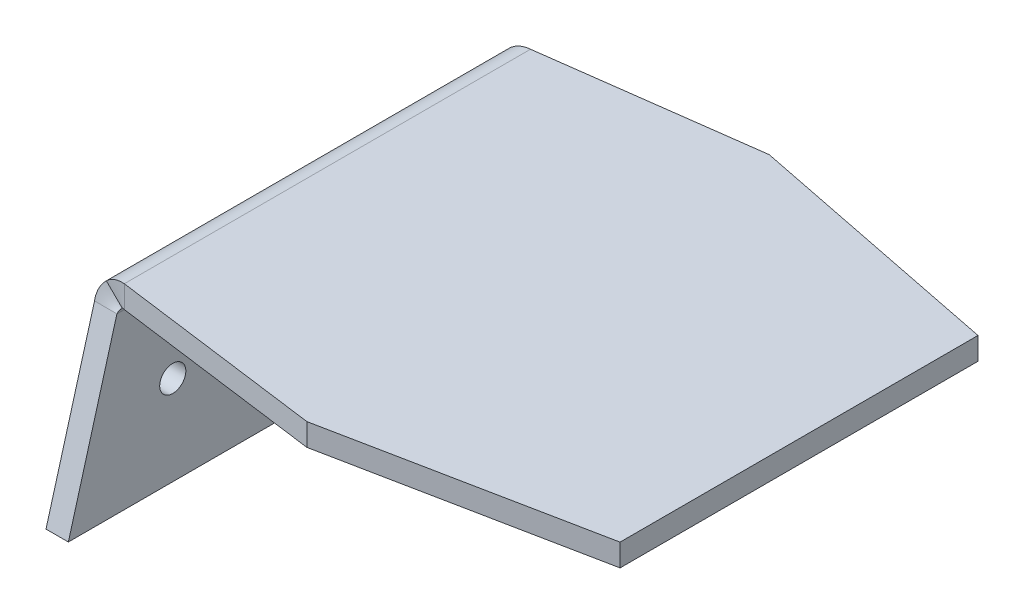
ISO-10303-21;
HEADER;
FILE_DESCRIPTION(('STEP AP214'),'2;1');
FILE_NAME('part.step','',(''),(''),'','','');
FILE_SCHEMA(('AUTOMOTIVE_DESIGN { 1 0 10303 214 1 1 1 1 }'));
ENDSEC;
DATA;
#1=APPLICATION_CONTEXT('core data for automotive mechanical design processes');
#2=APPLICATION_PROTOCOL_DEFINITION('international standard','automotive_design',2000,#1);
#3=PRODUCT_CONTEXT('',#1,'mechanical');
#4=PRODUCT('Part','Part','',(#3));
#5=PRODUCT_RELATED_PRODUCT_CATEGORY('part','',(#4));
#6=PRODUCT_DEFINITION_FORMATION('','',#4);
#7=PRODUCT_DEFINITION_CONTEXT('part definition',#1,'design');
#8=PRODUCT_DEFINITION('design','',#6,#7);
#9=PRODUCT_DEFINITION_SHAPE('','',#8);
#10=(LENGTH_UNIT() NAMED_UNIT(*) SI_UNIT(.MILLI.,.METRE.));
#11=(NAMED_UNIT(*) PLANE_ANGLE_UNIT() SI_UNIT($,.RADIAN.));
#12=(NAMED_UNIT(*) SI_UNIT($,.STERADIAN.) SOLID_ANGLE_UNIT());
#13=UNCERTAINTY_MEASURE_WITH_UNIT(LENGTH_MEASURE(1.E-05),#10,'distance_accuracy_value','');
#14=(GEOMETRIC_REPRESENTATION_CONTEXT(3) GLOBAL_UNCERTAINTY_ASSIGNED_CONTEXT((#13)) GLOBAL_UNIT_ASSIGNED_CONTEXT((#10,
#11,#12)) REPRESENTATION_CONTEXT('',''));
#15=CARTESIAN_POINT('',(0.,0.,0.));
#16=DIRECTION('',(0.,0.,1.));
#17=DIRECTION('',(1.,0.,0.));
#18=AXIS2_PLACEMENT_3D('',#15,#16,#17);
#19=CARTESIAN_POINT('',(26.0200215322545,66.0200215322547,-8.80000000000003));
#20=DIRECTION('',(1.,0.,0.));
#21=DIRECTION('',(0.,0.,-1.));
#22=AXIS2_PLACEMENT_3D('',#19,#20,#21);
#23=PLANE('',#22);
#24=CARTESIAN_POINT('',(26.0200215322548,-11.9799784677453,-20.));
#25=DIRECTION('',(-1.,0.,0.));
#26=DIRECTION('',(0.,0.,1.));
#27=AXIS2_PLACEMENT_3D('',#24,#25,#26);
#28=CIRCLE('',#27,1.75);
#29=CARTESIAN_POINT('',(26.0200215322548,-11.9799784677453,-18.25));
#30=VERTEX_POINT('',#29);
#31=EDGE_CURVE('E324',#30,#30,#28,.T.);
#32=ORIENTED_EDGE('',*,*,#31,.T.);
#33=EDGE_LOOP('',(#32));
#34=FACE_BOUND('',#33,.T.);
#35=CARTESIAN_POINT('',(26.0200215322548,-11.9799784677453,20.));
#36=DIRECTION('',(-1.,0.,0.));
#37=DIRECTION('',(0.,0.,-1.));
#38=AXIS2_PLACEMENT_3D('',#35,#36,#37);
#39=CIRCLE('',#38,1.75);
#40=CARTESIAN_POINT('',(26.0200215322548,-11.9799784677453,18.25));
#41=VERTEX_POINT('',#40);
#42=EDGE_CURVE('E327',#41,#41,#39,.T.);
#43=ORIENTED_EDGE('',*,*,#42,.T.);
#44=EDGE_LOOP('',(#43));
#45=FACE_BOUND('',#44,.T.);
#46=DIRECTION('',(0.,-0.962964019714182,-0.269629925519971));
#47=VECTOR('',#46,1.);
#48=CARTESIAN_POINT('',(26.0200215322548,-23.9799784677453,-34.));
#49=LINE('',#48,#47);
#50=CARTESIAN_POINT('',(26.0200215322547,-0.736600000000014,-27.4918540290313));
#51=VERTEX_POINT('',#50);
#52=CARTESIAN_POINT('',(26.0200215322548,-23.9799784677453,-34.));
#53=VERTEX_POINT('',#52);
#54=EDGE_CURVE('E84',#51,#53,#49,.T.);
#55=ORIENTED_EDGE('',*,*,#54,.F.);
#56=DIRECTION('',(0.,0.,1.));
#57=VECTOR('',#56,1.);
#58=CARTESIAN_POINT('',(26.0200215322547,-0.736600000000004,-8.80000000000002));
#59=LINE('',#58,#57);
#60=CARTESIAN_POINT('',(26.0200215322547,-0.736600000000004,27.4918540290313));
#61=VERTEX_POINT('',#60);
#62=EDGE_CURVE('E77',#51,#61,#59,.T.);
#63=ORIENTED_EDGE('',*,*,#62,.T.);
#64=DIRECTION('',(0.,0.962964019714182,-0.269629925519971));
#65=VECTOR('',#64,1.);
#66=CARTESIAN_POINT('',(26.0200215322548,-23.9799784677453,34.));
#67=LINE('',#66,#65);
#68=CARTESIAN_POINT('',(26.0200215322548,-23.9799784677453,34.));
#69=VERTEX_POINT('',#68);
#70=EDGE_CURVE('E92',#69,#61,#67,.T.);
#71=ORIENTED_EDGE('',*,*,#70,.F.);
#72=DIRECTION('',(0.,0.,1.));
#73=VECTOR('',#72,1.);
#74=CARTESIAN_POINT('',(26.0200215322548,-23.9799784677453,34.));
#75=LINE('',#74,#73);
#76=EDGE_CURVE('E345',#53,#69,#75,.T.);
#77=ORIENTED_EDGE('',*,*,#76,.F.);
#78=EDGE_LOOP('',(#55,#63,#71,#77));
#79=FACE_BOUND('',#78,.T.);
#80=ADVANCED_FACE('F65',(#34,#45,#79),#23,.T.);
#81=CARTESIAN_POINT('',(23.0200215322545,66.0200215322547,-8.80000000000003));
#82=DIRECTION('',(1.,0.,0.));
#83=DIRECTION('',(0.,0.,-1.));
#84=AXIS2_PLACEMENT_3D('',#81,#82,#83);
#85=PLANE('',#84);
#86=DIRECTION('',(0.,0.,1.));
#87=VECTOR('',#86,1.);
#88=CARTESIAN_POINT('',(23.0200215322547,-0.736600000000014,-8.80000000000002));
#89=LINE('',#88,#87);
#90=CARTESIAN_POINT('',(23.0200215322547,-0.736600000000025,-27.4918540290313));
#91=VERTEX_POINT('',#90);
#92=CARTESIAN_POINT('',(23.0200215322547,-0.736599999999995,27.4918540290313));
#93=VERTEX_POINT('',#92);
#94=EDGE_CURVE('E352',#91,#93,#89,.T.);
#95=ORIENTED_EDGE('',*,*,#94,.F.);
#96=DIRECTION('',(0.,-0.962964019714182,-0.269629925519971));
#97=VECTOR('',#96,1.);
#98=CARTESIAN_POINT('',(23.0200215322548,-23.9799784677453,-34.));
#99=LINE('',#98,#97);
#100=CARTESIAN_POINT('',(23.0200215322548,-23.9799784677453,-34.));
#101=VERTEX_POINT('',#100);
#102=EDGE_CURVE('E344',#91,#101,#99,.T.);
#103=ORIENTED_EDGE('',*,*,#102,.T.);
#104=DIRECTION('',(0.,0.,1.));
#105=VECTOR('',#104,1.);
#106=CARTESIAN_POINT('',(23.0200215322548,-23.9799784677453,34.));
#107=LINE('',#106,#105);
#108=CARTESIAN_POINT('',(23.0200215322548,-23.9799784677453,34.));
#109=VERTEX_POINT('',#108);
#110=EDGE_CURVE('E341',#101,#109,#107,.T.);
#111=ORIENTED_EDGE('',*,*,#110,.T.);
#112=DIRECTION('',(0.,0.962964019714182,-0.269629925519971));
#113=VECTOR('',#112,1.);
#114=CARTESIAN_POINT('',(23.0200215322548,-23.9799784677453,34.));
#115=LINE('',#114,#113);
#116=EDGE_CURVE('E343',#109,#93,#115,.T.);
#117=ORIENTED_EDGE('',*,*,#116,.T.);
#118=EDGE_LOOP('',(#95,#103,#111,#117));
#119=FACE_BOUND('',#118,.T.);
#120=CARTESIAN_POINT('',(23.0200215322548,-11.9799784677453,-20.));
#121=DIRECTION('',(-1.,0.,0.));
#122=DIRECTION('',(0.,0.,1.));
#123=AXIS2_PLACEMENT_3D('',#120,#121,#122);
#124=CIRCLE('',#123,1.75);
#125=CARTESIAN_POINT('',(23.0200215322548,-11.9799784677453,-18.25));
#126=VERTEX_POINT('',#125);
#127=EDGE_CURVE('E337',#126,#126,#124,.T.);
#128=ORIENTED_EDGE('',*,*,#127,.F.);
#129=EDGE_LOOP('',(#128));
#130=FACE_BOUND('',#129,.T.);
#131=CARTESIAN_POINT('',(23.0200215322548,-11.9799784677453,20.));
#132=DIRECTION('',(-1.,0.,0.));
#133=DIRECTION('',(0.,0.,-1.));
#134=AXIS2_PLACEMENT_3D('',#131,#132,#133);
#135=CIRCLE('',#134,1.75);
#136=CARTESIAN_POINT('',(23.0200215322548,-11.9799784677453,18.25));
#137=VERTEX_POINT('',#136);
#138=EDGE_CURVE('E329',#137,#137,#135,.T.);
#139=ORIENTED_EDGE('',*,*,#138,.F.);
#140=EDGE_LOOP('',(#139));
#141=FACE_BOUND('',#140,.T.);
#142=ADVANCED_FACE('F312',(#119,#130,#141),#85,.F.);
#143=CARTESIAN_POINT('',(23.0200215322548,-23.9799784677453,-34.));
#144=DIRECTION('',(0.,-0.269629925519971,0.962964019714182));
#145=DIRECTION('',(0.,0.962964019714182,0.269629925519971));
#146=AXIS2_PLACEMENT_3D('',#143,#144,#145);
#147=PLANE('',#146);
#148=CARTESIAN_POINT('',(26.0200215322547,-0.736600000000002,-27.4918540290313));
#149=CARTESIAN_POINT('',(23.0200215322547,-0.736600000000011,-27.4918540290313));
#150=B_SPLINE_CURVE_WITH_KNOTS('',1,(#148,#149),.UNSPECIFIED.,.F.,.F.,(2,2),(0.,1.),.UNSPECIFIED.);
#151=EDGE_CURVE('E12',#51,#91,#150,.T.);
#152=ORIENTED_EDGE('',*,*,#151,.F.);
#153=ORIENTED_EDGE('',*,*,#54,.T.);
#154=DIRECTION('',(1.,0.,0.));
#155=VECTOR('',#154,1.);
#156=CARTESIAN_POINT('',(23.0200215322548,-23.9799784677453,-34.));
#157=LINE('',#156,#155);
#158=EDGE_CURVE('E349',#101,#53,#157,.T.);
#159=ORIENTED_EDGE('',*,*,#158,.F.);
#160=ORIENTED_EDGE('',*,*,#102,.F.);
#161=EDGE_LOOP('',(#152,#153,#159,#160));
#162=FACE_BOUND('',#161,.T.);
#163=ADVANCED_FACE('F67',(#162),#147,.F.);
#164=CARTESIAN_POINT('',(23.0200215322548,-23.9799784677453,34.));
#165=DIRECTION('',(0.,1.,0.));
#166=DIRECTION('',(0.,0.,-1.));
#167=AXIS2_PLACEMENT_3D('',#164,#165,#166);
#168=PLANE('',#167);
#169=ORIENTED_EDGE('',*,*,#76,.T.);
#170=DIRECTION('',(1.,0.,0.));
#171=VECTOR('',#170,1.);
#172=CARTESIAN_POINT('',(23.0200215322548,-23.9799784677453,34.));
#173=LINE('',#172,#171);
#174=EDGE_CURVE('E347',#109,#69,#173,.T.);
#175=ORIENTED_EDGE('',*,*,#174,.F.);
#176=ORIENTED_EDGE('',*,*,#110,.F.);
#177=ORIENTED_EDGE('',*,*,#158,.T.);
#178=EDGE_LOOP('',(#169,#175,#176,#177));
#179=FACE_BOUND('',#178,.T.);
#180=ADVANCED_FACE('F308',(#179),#168,.F.);
#181=CARTESIAN_POINT('',(23.0200215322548,-23.9799784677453,34.));
#182=DIRECTION('',(0.,-0.269629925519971,-0.962964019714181));
#183=DIRECTION('',(0.,-0.962964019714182,0.269629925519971));
#184=AXIS2_PLACEMENT_3D('',#181,#182,#183);
#185=PLANE('',#184);
#186=CARTESIAN_POINT('',(23.0200215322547,-0.736599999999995,27.4918540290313));
#187=CARTESIAN_POINT('',(26.0200215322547,-0.736599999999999,27.4918540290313));
#188=B_SPLINE_CURVE_WITH_KNOTS('',1,(#186,#187),.UNSPECIFIED.,.F.,.F.,(2,2),(0.,1.),.UNSPECIFIED.);
#189=EDGE_CURVE('E358',#93,#61,#188,.T.);
#190=ORIENTED_EDGE('',*,*,#189,.F.);
#191=ORIENTED_EDGE('',*,*,#116,.F.);
#192=ORIENTED_EDGE('',*,*,#174,.T.);
#193=ORIENTED_EDGE('',*,*,#70,.T.);
#194=EDGE_LOOP('',(#190,#191,#192,#193));
#195=FACE_BOUND('',#194,.T.);
#196=ADVANCED_FACE('F306',(#195),#185,.F.);
#197=CARTESIAN_POINT('',(23.0200215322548,-11.9799784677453,-20.));
#198=DIRECTION('',(1.,0.,0.));
#199=DIRECTION('',(0.,0.,-1.));
#200=AXIS2_PLACEMENT_3D('',#197,#198,#199);
#201=CYLINDRICAL_SURFACE('',#200,1.75);
#202=ORIENTED_EDGE('',*,*,#127,.T.);
#203=EDGE_LOOP('',(#202));
#204=FACE_BOUND('',#203,.T.);
#205=ORIENTED_EDGE('',*,*,#31,.F.);
#206=EDGE_LOOP('',(#205));
#207=FACE_BOUND('',#206,.T.);
#208=ADVANCED_FACE('F302',(#204,#207),#201,.F.);
#209=CARTESIAN_POINT('',(23.0200215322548,-11.9799784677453,20.));
#210=DIRECTION('',(1.,0.,0.));
#211=DIRECTION('',(0.,0.,-1.));
#212=AXIS2_PLACEMENT_3D('',#209,#210,#211);
#213=CYLINDRICAL_SURFACE('',#212,1.75);
#214=ORIENTED_EDGE('',*,*,#138,.T.);
#215=EDGE_LOOP('',(#214));
#216=FACE_BOUND('',#215,.T.);
#217=ORIENTED_EDGE('',*,*,#42,.F.);
#218=EDGE_LOOP('',(#217));
#219=FACE_BOUND('',#218,.T.);
#220=ADVANCED_FACE('F298',(#216,#219),#213,.F.);
#221=CARTESIAN_POINT('',(55.,3.,-31.));
#222=DIRECTION('',(-0.196116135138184,0.,0.98058067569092));
#223=DIRECTION('',(0.98058067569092,0.,0.196116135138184));
#224=AXIS2_PLACEMENT_3D('',#221,#222,#223);
#225=PLANE('',#224);
#226=DIRECTION('',(-0.98058067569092,0.,-0.196116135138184));
#227=VECTOR('',#226,1.);
#228=CARTESIAN_POINT('',(55.,0.,-31.));
#229=LINE('',#228,#227);
#230=CARTESIAN_POINT('',(90.,0.,-24.));
#231=VERTEX_POINT('',#230);
#232=CARTESIAN_POINT('',(55.,0.,-31.));
#233=VERTEX_POINT('',#232);
#234=EDGE_CURVE('E720',#231,#233,#229,.T.);
#235=ORIENTED_EDGE('',*,*,#234,.T.);
#236=DIRECTION('',(0.,-1.,0.));
#237=VECTOR('',#236,1.);
#238=CARTESIAN_POINT('',(55.,3.,-31.));
#239=LINE('',#238,#237);
#240=CARTESIAN_POINT('',(55.,3.,-31.));
#241=VERTEX_POINT('',#240);
#242=EDGE_CURVE('E330',#241,#233,#239,.T.);
#243=ORIENTED_EDGE('',*,*,#242,.F.);
#244=DIRECTION('',(-0.98058067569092,0.,-0.196116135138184));
#245=VECTOR('',#244,1.);
#246=CARTESIAN_POINT('',(55.,3.,-31.));
#247=LINE('',#246,#245);
#248=CARTESIAN_POINT('',(90.,3.,-24.));
#249=VERTEX_POINT('',#248);
#250=EDGE_CURVE('E706',#249,#241,#247,.T.);
#251=ORIENTED_EDGE('',*,*,#250,.F.);
#252=DIRECTION('',(0.,-1.,0.));
#253=VECTOR('',#252,1.);
#254=CARTESIAN_POINT('',(90.,3.,-24.));
#255=LINE('',#254,#253);
#256=EDGE_CURVE('E717',#249,#231,#255,.T.);
#257=ORIENTED_EDGE('',*,*,#256,.T.);
#258=EDGE_LOOP('',(#235,#243,#251,#257));
#259=FACE_BOUND('',#258,.T.);
#260=ADVANCED_FACE('F301',(#259),#225,.F.);
#261=CARTESIAN_POINT('',(90.,3.,-24.));
#262=DIRECTION('',(-1.,0.,0.));
#263=DIRECTION('',(0.,0.,1.));
#264=AXIS2_PLACEMENT_3D('',#261,#262,#263);
#265=PLANE('',#264);
#266=DIRECTION('',(0.,0.,-1.));
#267=VECTOR('',#266,1.);
#268=CARTESIAN_POINT('',(90.,0.,-24.));
#269=LINE('',#268,#267);
#270=CARTESIAN_POINT('',(89.9999999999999,0.,24.));
#271=VERTEX_POINT('',#270);
#272=EDGE_CURVE('E715',#271,#231,#269,.T.);
#273=ORIENTED_EDGE('',*,*,#272,.T.);
#274=ORIENTED_EDGE('',*,*,#256,.F.);
#275=DIRECTION('',(0.,0.,-1.));
#276=VECTOR('',#275,1.);
#277=CARTESIAN_POINT('',(90.,3.,-24.));
#278=LINE('',#277,#276);
#279=CARTESIAN_POINT('',(89.9999999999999,3.,24.));
#280=VERTEX_POINT('',#279);
#281=EDGE_CURVE('E266',#280,#249,#278,.T.);
#282=ORIENTED_EDGE('',*,*,#281,.F.);
#283=DIRECTION('',(0.,-1.,0.));
#284=VECTOR('',#283,1.);
#285=CARTESIAN_POINT('',(89.9999999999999,3.,24.));
#286=LINE('',#285,#284);
#287=EDGE_CURVE('E712',#280,#271,#286,.T.);
#288=ORIENTED_EDGE('',*,*,#287,.T.);
#289=EDGE_LOOP('',(#273,#274,#282,#288));
#290=FACE_BOUND('',#289,.T.);
#291=ADVANCED_FACE('F511',(#290),#265,.F.);
#292=CARTESIAN_POINT('',(55.,3.,31.));
#293=DIRECTION('',(-0.196116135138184,0.,-0.98058067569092));
#294=DIRECTION('',(-0.98058067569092,0.,0.196116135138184));
#295=AXIS2_PLACEMENT_3D('',#292,#293,#294);
#296=PLANE('',#295);
#297=DIRECTION('',(0.98058067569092,0.,-0.196116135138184));
#298=VECTOR('',#297,1.);
#299=CARTESIAN_POINT('',(55.,0.,31.));
#300=LINE('',#299,#298);
#301=CARTESIAN_POINT('',(55.,0.,31.));
#302=VERTEX_POINT('',#301);
#303=EDGE_CURVE('E710',#302,#271,#300,.T.);
#304=ORIENTED_EDGE('',*,*,#303,.T.);
#305=ORIENTED_EDGE('',*,*,#287,.F.);
#306=DIRECTION('',(0.98058067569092,0.,-0.196116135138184));
#307=VECTOR('',#306,1.);
#308=CARTESIAN_POINT('',(55.,3.,31.));
#309=LINE('',#308,#307);
#310=CARTESIAN_POINT('',(55.,3.,31.));
#311=VERTEX_POINT('',#310);
#312=EDGE_CURVE('E264',#311,#280,#309,.T.);
#313=ORIENTED_EDGE('',*,*,#312,.F.);
#314=DIRECTION('',(0.,-1.,0.));
#315=VECTOR('',#314,1.);
#316=CARTESIAN_POINT('',(55.,3.,31.));
#317=LINE('',#316,#315);
#318=EDGE_CURVE('E262',#311,#302,#317,.T.);
#319=ORIENTED_EDGE('',*,*,#318,.T.);
#320=EDGE_LOOP('',(#304,#305,#313,#319));
#321=FACE_BOUND('',#320,.T.);
#322=ADVANCED_FACE('F519',(#321),#296,.F.);
#323=CARTESIAN_POINT('',(90.,3.,-8.8));
#324=DIRECTION('',(0.,-1.,0.));
#325=DIRECTION('',(0.,0.,-1.));
#326=AXIS2_PLACEMENT_3D('',#323,#324,#325);
#327=PLANE('',#326);
#328=DIRECTION('',(-0.991227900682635,0.,0.132163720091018));
#329=VECTOR('',#328,1.);
#330=CARTESIAN_POINT('',(25.,3.,-27.));
#331=LINE('',#330,#329);
#332=CARTESIAN_POINT('',(26.7566215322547,3.,-27.2342162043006));
#333=VERTEX_POINT('',#332);
#334=EDGE_CURVE('E253',#241,#333,#331,.T.);
#335=ORIENTED_EDGE('',*,*,#334,.T.);
#336=DIRECTION('',(0.,0.,1.));
#337=VECTOR('',#336,1.);
#338=CARTESIAN_POINT('',(26.7566215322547,3.,-8.80000000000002));
#339=LINE('',#338,#337);
#340=CARTESIAN_POINT('',(26.7566215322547,3.,27.2342162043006));
#341=VERTEX_POINT('',#340);
#342=EDGE_CURVE('E194',#333,#341,#339,.T.);
#343=ORIENTED_EDGE('',*,*,#342,.T.);
#344=DIRECTION('',(0.991227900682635,0.,0.132163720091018));
#345=VECTOR('',#344,1.);
#346=CARTESIAN_POINT('',(25.,3.,27.));
#347=LINE('',#346,#345);
#348=EDGE_CURVE('E250',#341,#311,#347,.T.);
#349=ORIENTED_EDGE('',*,*,#348,.T.);
#350=ORIENTED_EDGE('',*,*,#312,.T.);
#351=ORIENTED_EDGE('',*,*,#281,.T.);
#352=ORIENTED_EDGE('',*,*,#250,.T.);
#353=EDGE_LOOP('',(#335,#343,#349,#350,#351,#352));
#354=FACE_BOUND('',#353,.T.);
#355=ADVANCED_FACE('F249',(#354),#327,.F.);
#356=CARTESIAN_POINT('',(25.,3.,27.));
#357=DIRECTION('',(0.132163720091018,0.,-0.991227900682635));
#358=DIRECTION('',(-0.991227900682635,0.,-0.132163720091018));
#359=AXIS2_PLACEMENT_3D('',#356,#357,#358);
#360=PLANE('',#359);
#361=ORIENTED_EDGE('',*,*,#348,.F.);
#362=CARTESIAN_POINT('',(26.7566215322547,0.,27.2342162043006));
#363=CARTESIAN_POINT('',(26.7566215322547,3.,27.2342162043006));
#364=B_SPLINE_CURVE_WITH_KNOTS('',1,(#362,#363),.UNSPECIFIED.,.F.,.F.,(2,2),(0.,1.),.UNSPECIFIED.);
#365=CARTESIAN_POINT('',(26.7566215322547,0.,27.2342162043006));
#366=VERTEX_POINT('',#365);
#367=EDGE_CURVE('E259',#341,#366,#364,.F.);
#368=ORIENTED_EDGE('',*,*,#367,.T.);
#369=DIRECTION('',(0.991227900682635,0.,0.132163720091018));
#370=VECTOR('',#369,1.);
#371=CARTESIAN_POINT('',(25.,0.,27.));
#372=LINE('',#371,#370);
#373=EDGE_CURVE('E725',#366,#302,#372,.T.);
#374=ORIENTED_EDGE('',*,*,#373,.T.);
#375=ORIENTED_EDGE('',*,*,#318,.F.);
#376=EDGE_LOOP('',(#361,#368,#374,#375));
#377=FACE_BOUND('',#376,.T.);
#378=ADVANCED_FACE('F258',(#377),#360,.F.);
#379=CARTESIAN_POINT('',(90.,0.,-8.8));
#380=DIRECTION('',(0.,-1.,0.));
#381=DIRECTION('',(0.,0.,-1.));
#382=AXIS2_PLACEMENT_3D('',#379,#380,#381);
#383=PLANE('',#382);
#384=DIRECTION('',(0.,0.,1.));
#385=VECTOR('',#384,1.);
#386=CARTESIAN_POINT('',(26.7566215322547,0.,-8.80000000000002));
#387=LINE('',#386,#385);
#388=CARTESIAN_POINT('',(26.7566215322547,0.,-27.2342162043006));
#389=VERTEX_POINT('',#388);
#390=EDGE_CURVE('E174',#389,#366,#387,.T.);
#391=ORIENTED_EDGE('',*,*,#390,.F.);
#392=DIRECTION('',(-0.991227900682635,0.,0.132163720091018));
#393=VECTOR('',#392,1.);
#394=CARTESIAN_POINT('',(25.,0.,-27.));
#395=LINE('',#394,#393);
#396=EDGE_CURVE('E284',#233,#389,#395,.T.);
#397=ORIENTED_EDGE('',*,*,#396,.F.);
#398=ORIENTED_EDGE('',*,*,#234,.F.);
#399=ORIENTED_EDGE('',*,*,#272,.F.);
#400=ORIENTED_EDGE('',*,*,#303,.F.);
#401=ORIENTED_EDGE('',*,*,#373,.F.);
#402=EDGE_LOOP('',(#391,#397,#398,#399,#400,#401));
#403=FACE_BOUND('',#402,.T.);
#404=ADVANCED_FACE('F296',(#403),#383,.T.);
#405=CARTESIAN_POINT('',(25.,3.,-27.));
#406=DIRECTION('',(0.132163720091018,0.,0.991227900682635));
#407=DIRECTION('',(0.991227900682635,0.,-0.132163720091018));
#408=AXIS2_PLACEMENT_3D('',#405,#406,#407);
#409=PLANE('',#408);
#410=ORIENTED_EDGE('',*,*,#396,.T.);
#411=CARTESIAN_POINT('',(26.7566215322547,3.,-27.2342162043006));
#412=CARTESIAN_POINT('',(26.7566215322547,0.,-27.2342162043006));
#413=B_SPLINE_CURVE_WITH_KNOTS('',1,(#411,#412),.UNSPECIFIED.,.F.,.F.,(2,2),(0.,1.),.UNSPECIFIED.);
#414=EDGE_CURVE('E279',#389,#333,#413,.F.);
#415=ORIENTED_EDGE('',*,*,#414,.T.);
#416=ORIENTED_EDGE('',*,*,#334,.F.);
#417=ORIENTED_EDGE('',*,*,#242,.T.);
#418=EDGE_LOOP('',(#410,#415,#416,#417));
#419=FACE_BOUND('',#418,.T.);
#420=ADVANCED_FACE('F286',(#419),#409,.F.);
#421=CARTESIAN_POINT('',(24.1144463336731,1.90557519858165,-27.));
#422=CARTESIAN_POINT('',(23.7685257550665,1.5596546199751,-27.0819900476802));
#423=CARTESIAN_POINT('',(23.4916313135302,1.1452226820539,-27.1639513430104));
#424=CARTESIAN_POINT('',(23.1172752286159,0.241447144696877,-27.3279026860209));
#425=CARTESIAN_POINT('',(23.0200215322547,-0.247394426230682,-27.4098639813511));
#426=CARTESIAN_POINT('',(23.0200215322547,-0.736600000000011,-27.4918540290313));
#427=CARTESIAN_POINT('',(26.2357666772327,-0.215745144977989,-27.));
#428=CARTESIAN_POINT('',(26.1675798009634,-0.283932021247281,-27.0819842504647));
#429=CARTESIAN_POINT('',(26.112990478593,-0.365634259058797,-27.1639513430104));
#430=CARTESIAN_POINT('',(26.0391932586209,-0.543796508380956,-27.3279026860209));
#431=CARTESIAN_POINT('',(26.0200215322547,-0.640169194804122,-27.4098697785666));
#432=CARTESIAN_POINT('',(26.0200215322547,-0.736600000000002,-27.4918540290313));
#433=B_SPLINE_SURFACE_WITH_KNOTS('',1,3,((#421,#422,#423,#424,#425,#426),(#427,#428,#429,#430,
#431,#432)),.UNSPECIFIED.,.F.,.F.,.F.,(2,2),(4,2,4),(0.,1.),(0.,0.5,1.),.UNSPECIFIED.);
#434=CARTESIAN_POINT('',(26.2357666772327,-0.215745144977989,-27.));
#435=CARTESIAN_POINT('',(24.1144463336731,1.90557519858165,-27.));
#436=B_SPLINE_CURVE_WITH_KNOTS('',1,(#434,#435),.UNSPECIFIED.,.F.,.F.,(2,2),(0.,1.),.UNSPECIFIED.);
#437=CARTESIAN_POINT('',(26.2357666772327,-0.21574514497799,-27.));
#438=VERTEX_POINT('',#437);
#439=CARTESIAN_POINT('',(24.1144463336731,1.90557519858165,-27.));
#440=VERTEX_POINT('',#439);
#441=EDGE_CURVE('E159',#438,#440,#436,.T.);
#442=CARTESIAN_POINT('',(26.2357666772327,-0.215745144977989,-27.));
#443=CARTESIAN_POINT('',(26.1675798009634,-0.283932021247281,-27.0819842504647));
#444=CARTESIAN_POINT('',(26.112990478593,-0.365634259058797,-27.1639513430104));
#445=CARTESIAN_POINT('',(26.0391932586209,-0.543796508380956,-27.3279026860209));
#446=CARTESIAN_POINT('',(26.0200215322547,-0.640169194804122,-27.4098697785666));
#447=CARTESIAN_POINT('',(26.0200215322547,-0.736600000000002,-27.4918540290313));
#448=B_SPLINE_CURVE_WITH_KNOTS('',3,(#442,#443,#444,#445,#446,#447),.UNSPECIFIED.,.F.,.F.,(4,2,
4),(0.,0.5,1.),.UNSPECIFIED.);
#449=EDGE_CURVE('E475',#438,#51,#448,.T.);
#450=CARTESIAN_POINT('',(23.0200215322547,-0.736600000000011,-27.4918540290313));
#451=CARTESIAN_POINT('',(23.0200215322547,-0.247394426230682,-27.4098639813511));
#452=CARTESIAN_POINT('',(23.1172752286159,0.241447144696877,-27.3279026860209));
#453=CARTESIAN_POINT('',(23.4916313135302,1.1452226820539,-27.1639513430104));
#454=CARTESIAN_POINT('',(23.7685257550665,1.5596546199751,-27.0819900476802));
#455=CARTESIAN_POINT('',(24.1144463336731,1.90557519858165,-27.));
#456=B_SPLINE_CURVE_WITH_KNOTS('',3,(#450,#451,#452,#453,#454,#455),.UNSPECIFIED.,.F.,.F.,(4,2,
4),(0.,0.5,1.),.UNSPECIFIED.);
#457=EDGE_CURVE('E179',#440,#91,#456,.F.);
#458=ORIENTED_EDGE('',*,*,#441,.F.);
#459=ORIENTED_EDGE('',*,*,#449,.T.);
#460=ORIENTED_EDGE('',*,*,#151,.T.);
#461=ORIENTED_EDGE('',*,*,#457,.F.);
#462=EDGE_LOOP('',(#458,#459,#460,#461));
#463=FACE_BOUND('',#462,.T.);
#464=ADVANCED_FACE('F181',(#463),#433,.T.);
#465=CARTESIAN_POINT('',(23.0200215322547,-0.736599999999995,27.4918540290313));
#466=CARTESIAN_POINT('',(23.0200215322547,-0.24739442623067,27.4098639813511));
#467=CARTESIAN_POINT('',(23.1172752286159,0.241447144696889,27.3279026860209));
#468=CARTESIAN_POINT('',(23.4916313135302,1.1452226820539,27.1639513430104));
#469=CARTESIAN_POINT('',(23.7685257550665,1.55965461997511,27.0819900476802));
#470=CARTESIAN_POINT('',(24.1144463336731,1.90557519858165,27.));
#471=CARTESIAN_POINT('',(26.0200215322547,-0.736599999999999,27.4918540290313));
#472=CARTESIAN_POINT('',(26.0200215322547,-0.640169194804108,27.4098697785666));
#473=CARTESIAN_POINT('',(26.0391932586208,-0.543796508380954,27.3279026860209));
#474=CARTESIAN_POINT('',(26.112990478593,-0.365634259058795,27.1639513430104));
#475=CARTESIAN_POINT('',(26.1675798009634,-0.283932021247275,27.0819842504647));
#476=CARTESIAN_POINT('',(26.2357666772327,-0.215745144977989,27.));
#477=B_SPLINE_SURFACE_WITH_KNOTS('',1,3,((#465,#466,#467,#468,#469,#470),(#471,#472,#473,#474,
#475,#476)),.UNSPECIFIED.,.F.,.F.,.F.,(2,2),(4,2,4),(0.,1.),(0.,0.5,1.),.UNSPECIFIED.);
#478=CARTESIAN_POINT('',(26.0200215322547,-0.736599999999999,27.4918540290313));
#479=CARTESIAN_POINT('',(26.0200215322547,-0.640169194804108,27.4098697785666));
#480=CARTESIAN_POINT('',(26.0391932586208,-0.543796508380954,27.3279026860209));
#481=CARTESIAN_POINT('',(26.112990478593,-0.365634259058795,27.1639513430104));
#482=CARTESIAN_POINT('',(26.1675798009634,-0.283932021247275,27.0819842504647));
#483=CARTESIAN_POINT('',(26.2357666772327,-0.215745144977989,27.));
#484=B_SPLINE_CURVE_WITH_KNOTS('',3,(#478,#479,#480,#481,#482,#483),.UNSPECIFIED.,.F.,.F.,(4,2,
4),(0.,0.5,1.),.UNSPECIFIED.);
#485=CARTESIAN_POINT('',(26.2357666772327,-0.21574514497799,27.));
#486=VERTEX_POINT('',#485);
#487=EDGE_CURVE('E471',#61,#486,#484,.T.);
#488=CARTESIAN_POINT('',(26.2357666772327,-0.215745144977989,27.));
#489=CARTESIAN_POINT('',(24.1144463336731,1.90557519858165,27.));
#490=B_SPLINE_CURVE_WITH_KNOTS('',1,(#488,#489),.UNSPECIFIED.,.F.,.F.,(2,2),(0.,1.),.UNSPECIFIED.);
#491=CARTESIAN_POINT('',(24.1144463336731,1.90557519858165,27.));
#492=VERTEX_POINT('',#491);
#493=EDGE_CURVE('E175',#486,#492,#490,.T.);
#494=CARTESIAN_POINT('',(24.1144463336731,1.90557519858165,27.));
#495=CARTESIAN_POINT('',(23.7685257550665,1.55965461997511,27.0819900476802));
#496=CARTESIAN_POINT('',(23.4916313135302,1.1452226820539,27.1639513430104));
#497=CARTESIAN_POINT('',(23.1172752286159,0.241447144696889,27.3279026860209));
#498=CARTESIAN_POINT('',(23.0200215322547,-0.24739442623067,27.4098639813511));
#499=CARTESIAN_POINT('',(23.0200215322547,-0.736599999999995,27.4918540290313));
#500=B_SPLINE_CURVE_WITH_KNOTS('',3,(#494,#495,#496,#497,#498,#499),.UNSPECIFIED.,.F.,.F.,(4,2,
4),(0.,0.5,1.),.UNSPECIFIED.);
#501=EDGE_CURVE('E187',#93,#492,#500,.F.);
#502=ORIENTED_EDGE('',*,*,#189,.T.);
#503=ORIENTED_EDGE('',*,*,#487,.T.);
#504=ORIENTED_EDGE('',*,*,#493,.T.);
#505=ORIENTED_EDGE('',*,*,#501,.F.);
#506=EDGE_LOOP('',(#502,#503,#504,#505));
#507=FACE_BOUND('',#506,.T.);
#508=ADVANCED_FACE('F394',(#507),#477,.T.);
#509=CARTESIAN_POINT('',(24.1144463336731,1.90557519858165,27.));
#510=CARTESIAN_POINT('',(24.4603682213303,2.25149708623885,27.0390430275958));
#511=CARTESIAN_POINT('',(24.8747988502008,2.52839021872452,27.0780720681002));
#512=CARTESIAN_POINT('',(25.7785743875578,2.90274630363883,27.1561441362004));
#513=CARTESIAN_POINT('',(26.2674141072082,3.,27.1951731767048));
#514=CARTESIAN_POINT('',(26.7566215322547,3.,27.2342162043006));
#515=CARTESIAN_POINT('',(26.2357666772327,-0.215745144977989,27.));
#516=CARTESIAN_POINT('',(26.3039569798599,-0.147554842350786,27.0390420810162));
#517=CARTESIAN_POINT('',(26.3856557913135,-0.0929689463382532,27.0780720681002));
#518=CARTESIAN_POINT('',(26.5638180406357,-0.0191717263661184,27.1561441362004));
#519=CARTESIAN_POINT('',(26.660185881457,0.,27.1951741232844));
#520=CARTESIAN_POINT('',(26.7566215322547,0.,27.2342162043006));
#521=B_SPLINE_SURFACE_WITH_KNOTS('',1,3,((#509,#510,#511,#512,#513,#514),(#515,#516,#517,#518,
#519,#520)),.UNSPECIFIED.,.F.,.F.,.F.,(2,2),(4,2,4),(0.,1.),(0.,0.5,1.),.UNSPECIFIED.);
#522=CARTESIAN_POINT('',(26.2357666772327,-0.215745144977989,27.));
#523=CARTESIAN_POINT('',(26.3039569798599,-0.147554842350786,27.0390420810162));
#524=CARTESIAN_POINT('',(26.3856557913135,-0.0929689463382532,27.0780720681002));
#525=CARTESIAN_POINT('',(26.5638180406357,-0.0191717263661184,27.1561441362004));
#526=CARTESIAN_POINT('',(26.660185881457,0.,27.1951741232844));
#527=CARTESIAN_POINT('',(26.7566215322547,0.,27.2342162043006));
#528=B_SPLINE_CURVE_WITH_KNOTS('',3,(#522,#523,#524,#525,#526,#527),.UNSPECIFIED.,.F.,.F.,(4,2,
4),(0.,0.5,1.),.UNSPECIFIED.);
#529=EDGE_CURVE('E467',#486,#366,#528,.T.);
#530=CARTESIAN_POINT('',(26.7566215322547,3.,27.2342162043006));
#531=CARTESIAN_POINT('',(26.2674141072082,3.,27.1951731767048));
#532=CARTESIAN_POINT('',(25.7785743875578,2.90274630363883,27.1561441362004));
#533=CARTESIAN_POINT('',(24.8747988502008,2.52839021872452,27.0780720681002));
#534=CARTESIAN_POINT('',(24.4603682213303,2.25149708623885,27.0390430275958));
#535=CARTESIAN_POINT('',(24.1144463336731,1.90557519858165,27.));
#536=B_SPLINE_CURVE_WITH_KNOTS('',3,(#530,#531,#532,#533,#534,#535),.UNSPECIFIED.,.F.,.F.,(4,2,
4),(0.,0.5,1.),.UNSPECIFIED.);
#537=EDGE_CURVE('E196',#492,#341,#536,.F.);
#538=ORIENTED_EDGE('',*,*,#493,.F.);
#539=ORIENTED_EDGE('',*,*,#529,.T.);
#540=ORIENTED_EDGE('',*,*,#367,.F.);
#541=ORIENTED_EDGE('',*,*,#537,.F.);
#542=EDGE_LOOP('',(#538,#539,#540,#541));
#543=FACE_BOUND('',#542,.T.);
#544=ADVANCED_FACE('F415',(#543),#521,.T.);
#545=CARTESIAN_POINT('',(26.7566215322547,3.,-27.2342162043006));
#546=CARTESIAN_POINT('',(26.2674141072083,3.,-27.1951731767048));
#547=CARTESIAN_POINT('',(25.7785743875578,2.90274630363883,-27.1561441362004));
#548=CARTESIAN_POINT('',(24.8747988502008,2.52839021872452,-27.0780720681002));
#549=CARTESIAN_POINT('',(24.4603682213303,2.25149708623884,-27.0390430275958));
#550=CARTESIAN_POINT('',(24.1144463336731,1.90557519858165,-27.));
#551=CARTESIAN_POINT('',(26.7566215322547,0.,-27.2342162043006));
#552=CARTESIAN_POINT('',(26.660185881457,0.,-27.1951741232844));
#553=CARTESIAN_POINT('',(26.5638180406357,-0.0191717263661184,-27.1561441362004));
#554=CARTESIAN_POINT('',(26.3856557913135,-0.0929689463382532,-27.0780720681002));
#555=CARTESIAN_POINT('',(26.3039569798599,-0.147554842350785,-27.0390420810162));
#556=CARTESIAN_POINT('',(26.2357666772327,-0.215745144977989,-27.));
#557=B_SPLINE_SURFACE_WITH_KNOTS('',1,3,((#545,#546,#547,#548,#549,#550),(#551,#552,#553,#554,
#555,#556)),.UNSPECIFIED.,.F.,.F.,.F.,(2,2),(4,2,4),(0.,1.),(0.,0.5,1.),.UNSPECIFIED.);
#558=CARTESIAN_POINT('',(26.7566215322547,0.,-27.2342162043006));
#559=CARTESIAN_POINT('',(26.660185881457,0.,-27.1951741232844));
#560=CARTESIAN_POINT('',(26.5638180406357,-0.0191717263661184,-27.1561441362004));
#561=CARTESIAN_POINT('',(26.3856557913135,-0.0929689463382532,-27.0780720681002));
#562=CARTESIAN_POINT('',(26.3039569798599,-0.147554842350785,-27.0390420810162));
#563=CARTESIAN_POINT('',(26.2357666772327,-0.215745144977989,-27.));
#564=B_SPLINE_CURVE_WITH_KNOTS('',3,(#558,#559,#560,#561,#562,#563),.UNSPECIFIED.,.F.,.F.,(4,2,
4),(0.,0.5,1.),.UNSPECIFIED.);
#565=EDGE_CURVE('E168',#389,#438,#564,.T.);
#566=CARTESIAN_POINT('',(24.1144463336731,1.90557519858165,-27.));
#567=CARTESIAN_POINT('',(24.4603682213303,2.25149708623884,-27.0390430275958));
#568=CARTESIAN_POINT('',(24.8747988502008,2.52839021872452,-27.0780720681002));
#569=CARTESIAN_POINT('',(25.7785743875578,2.90274630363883,-27.1561441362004));
#570=CARTESIAN_POINT('',(26.2674141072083,3.,-27.1951731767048));
#571=CARTESIAN_POINT('',(26.7566215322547,3.,-27.2342162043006));
#572=B_SPLINE_CURVE_WITH_KNOTS('',3,(#566,#567,#568,#569,#570,#571),.UNSPECIFIED.,.F.,.F.,(4,2,
4),(0.,0.5,1.),.UNSPECIFIED.);
#573=EDGE_CURVE('E164',#333,#440,#572,.F.);
#574=ORIENTED_EDGE('',*,*,#565,.T.);
#575=ORIENTED_EDGE('',*,*,#441,.T.);
#576=ORIENTED_EDGE('',*,*,#573,.F.);
#577=ORIENTED_EDGE('',*,*,#414,.F.);
#578=EDGE_LOOP('',(#574,#575,#576,#577));
#579=FACE_BOUND('',#578,.T.);
#580=ADVANCED_FACE('F162',(#579),#557,.T.);
#581=CARTESIAN_POINT('',(26.7566215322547,-0.7366,-55.1774503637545));
#582=DIRECTION('',(0.,0.,1.));
#583=DIRECTION('',(1.,0.,0.));
#584=AXIS2_PLACEMENT_3D('',#581,#582,#583);
#585=CYLINDRICAL_SURFACE('',#584,3.7366);
#586=ORIENTED_EDGE('',*,*,#342,.F.);
#587=ORIENTED_EDGE('',*,*,#573,.T.);
#588=ORIENTED_EDGE('',*,*,#457,.T.);
#589=ORIENTED_EDGE('',*,*,#94,.T.);
#590=ORIENTED_EDGE('',*,*,#501,.T.);
#591=ORIENTED_EDGE('',*,*,#537,.T.);
#592=EDGE_LOOP('',(#586,#587,#588,#589,#590,#591));
#593=FACE_BOUND('',#592,.T.);
#594=ADVANCED_FACE('F191',(#593),#585,.T.);
#595=CARTESIAN_POINT('',(26.7566215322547,-0.7366,-55.1774503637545));
#596=DIRECTION('',(0.,0.,1.));
#597=DIRECTION('',(1.,0.,0.));
#598=AXIS2_PLACEMENT_3D('',#595,#596,#597);
#599=CYLINDRICAL_SURFACE('',#598,0.7366);
#600=ORIENTED_EDGE('',*,*,#390,.T.);
#601=ORIENTED_EDGE('',*,*,#529,.F.);
#602=ORIENTED_EDGE('',*,*,#487,.F.);
#603=ORIENTED_EDGE('',*,*,#62,.F.);
#604=ORIENTED_EDGE('',*,*,#449,.F.);
#605=ORIENTED_EDGE('',*,*,#565,.F.);
#606=EDGE_LOOP('',(#600,#601,#602,#603,#604,#605));
#607=FACE_BOUND('',#606,.T.);
#608=ADVANCED_FACE('F218',(#607),#599,.F.);
#609=CLOSED_SHELL('',(#80,#142,#163,#180,#196,#208,#220,#260,#291,#322,#355,#378,#404,#420,#464,
#508,#544,#580,#594,#608));
#610=MANIFOLD_SOLID_BREP('B2',#609);
#611=ADVANCED_BREP_SHAPE_REPRESENTATION('',(#18,#610),#14);
#612=SHAPE_DEFINITION_REPRESENTATION(#9,#611);
ENDSEC;
END-ISO-10303-21;
